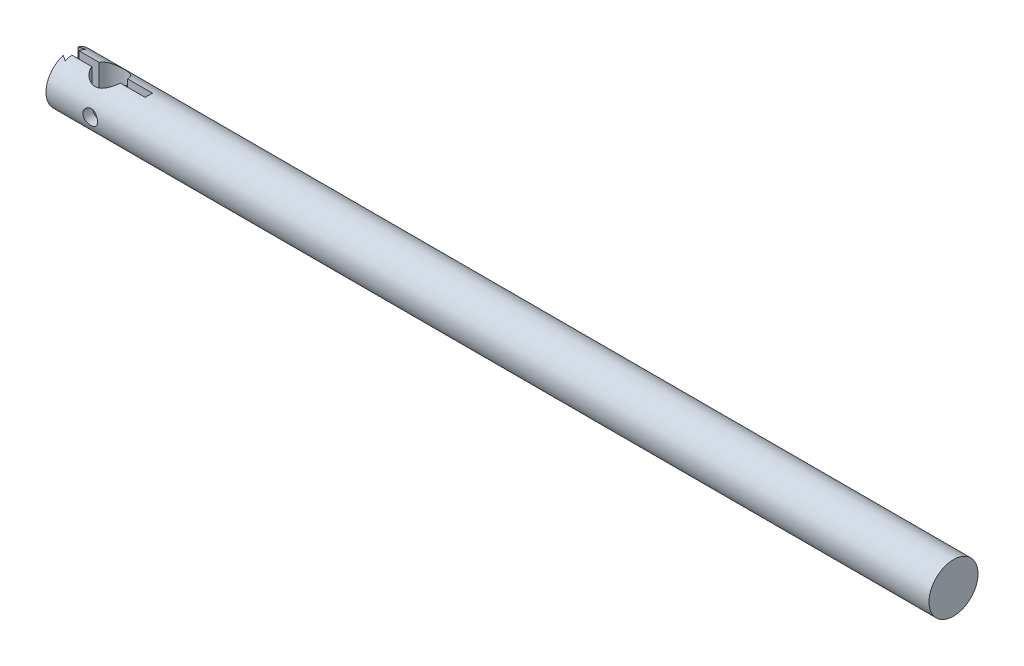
from build123d import *

# Parameters (mm, degrees)
ESQUISSE1_W             = 180
ESQUISSE1_H             = 5
ENL_V_MAT_EXTRU_1_DEPTH = 20
ESQUISSE3_W             = 15
ESQUISSE3_H             = 1.5
ENL_V_MAT_EXTRU_2_DEPTH = 20
ESQUISSE4_R             = 1.5
ENL_V_MAT_EXTRU_3_DEPTH = 20
ESQUISSE5_R             = 3
ENL_V_MAT_EXTRU_4_DEPTH = 15


with BuildPart() as part:
    # Esquisse1 → R_volution1 (revolve)
    with BuildSketch(Plane.XY, mode=Mode.PRIVATE) as r_volution1_sk:
        with Locations((90, 2.5)):
            Rectangle(ESQUISSE1_W, ESQUISSE1_H)
    revolve(r_volution1_sk.sketch.rotate(Axis((-14.438791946, 0, 0), (1, 0, 0)), 90), axis=Axis((-14.438791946, 0, 0), (1, 0, 0)))

    # Esquisse2 → Enl_v. mat.-Extru.1 (cut, symmetric)
    with BuildSketch(Plane(origin=(0, 0, 0), x_dir=(1, 0, 0), z_dir=(0, 1, 0))):
        Polygon((0, -1.5), (1, -2.077350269), (1, 2.077350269), (0, 1.5), align=None)
    extrude(amount=ENL_V_MAT_EXTRU_1_DEPTH, both=True, mode=Mode.SUBTRACT)

    # Esquisse3 → Enl_v. mat.-Extru.2 (cut, symmetric)
    with BuildSketch(Plane(origin=(0, 0, 0), x_dir=(1, 0, 0), z_dir=(0, 1, 0))):
        with Locations((8.5, 0)):
            Rectangle(ESQUISSE3_W, ESQUISSE3_H)
    extrude(amount=ENL_V_MAT_EXTRU_2_DEPTH, both=True, mode=Mode.SUBTRACT)

    # Esquisse4 → Enl_v. mat.-Extru.3 (cut, symmetric)
    with BuildSketch(Plane.XY):
        with Locations((9, 0)):
            Circle(ESQUISSE4_R)
    extrude(amount=ENL_V_MAT_EXTRU_3_DEPTH, both=True, mode=Mode.SUBTRACT)

    # Esquisse5 → Enl_v. mat.-Extru.4 (cut, symmetric)
    with BuildSketch(Plane(origin=(0, 0, 0), x_dir=(1, 0, 0), z_dir=(0, 1, 0))):
        with Locations((8, 0)):
            Circle(ESQUISSE5_R)
    extrude(amount=ENL_V_MAT_EXTRU_4_DEPTH, both=True, mode=Mode.SUBTRACT)


solid = part.part
